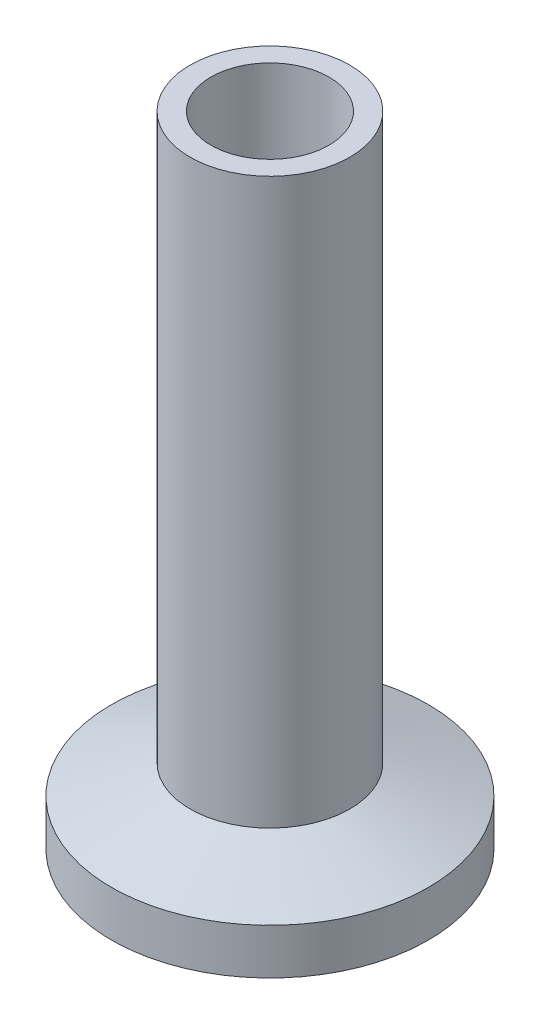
ISO-10303-21;
HEADER;
FILE_DESCRIPTION(('STEP AP214'),'2;1');
FILE_NAME('part.step','',(''),(''),'','','');
FILE_SCHEMA(('AUTOMOTIVE_DESIGN { 1 0 10303 214 1 1 1 1 }'));
ENDSEC;
DATA;
#1=APPLICATION_CONTEXT('core data for automotive mechanical design processes');
#2=APPLICATION_PROTOCOL_DEFINITION('international standard','automotive_design',2000,#1);
#3=PRODUCT_CONTEXT('',#1,'mechanical');
#4=PRODUCT('Part','Part','',(#3));
#5=PRODUCT_RELATED_PRODUCT_CATEGORY('part','',(#4));
#6=PRODUCT_DEFINITION_FORMATION('','',#4);
#7=PRODUCT_DEFINITION_CONTEXT('part definition',#1,'design');
#8=PRODUCT_DEFINITION('design','',#6,#7);
#9=PRODUCT_DEFINITION_SHAPE('','',#8);
#10=(LENGTH_UNIT() NAMED_UNIT(*) SI_UNIT(.MILLI.,.METRE.));
#11=(NAMED_UNIT(*) PLANE_ANGLE_UNIT() SI_UNIT($,.RADIAN.));
#12=(NAMED_UNIT(*) SI_UNIT($,.STERADIAN.) SOLID_ANGLE_UNIT());
#13=UNCERTAINTY_MEASURE_WITH_UNIT(LENGTH_MEASURE(1.E-05),#10,'distance_accuracy_value','');
#14=(GEOMETRIC_REPRESENTATION_CONTEXT(3) GLOBAL_UNCERTAINTY_ASSIGNED_CONTEXT((#13)) GLOBAL_UNIT_ASSIGNED_CONTEXT((#10,
#11,#12)) REPRESENTATION_CONTEXT('',''));
#15=CARTESIAN_POINT('',(0.,0.,0.));
#16=DIRECTION('',(0.,0.,1.));
#17=DIRECTION('',(1.,0.,0.));
#18=AXIS2_PLACEMENT_3D('',#15,#16,#17);
#19=CARTESIAN_POINT('',(0.,0.,0.));
#20=DIRECTION('',(0.,-1.,0.));
#21=DIRECTION('',(0.,0.,-1.00000000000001));
#22=AXIS2_PLACEMENT_3D('',#19,#20,#21);
#23=CYLINDRICAL_SURFACE('',#22,10.922);
#24=CARTESIAN_POINT('',(6.66133814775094E-13,1.32079999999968,1.4432899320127E-12));
#25=DIRECTION('',(0.,-1.,0.));
#26=DIRECTION('',(0.,0.,-1.00000000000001));
#27=AXIS2_PLACEMENT_3D('',#24,#25,#26);
#28=CIRCLE('',#27,10.922);
#29=CARTESIAN_POINT('',(6.65716507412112E-13,1.32079999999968,-10.9219999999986));
#30=VERTEX_POINT('',#29);
#31=EDGE_CURVE('E12',#30,#30,#28,.T.);
#32=ORIENTED_EDGE('',*,*,#31,.F.);
#33=EDGE_LOOP('',(#32));
#34=FACE_BOUND('',#33,.T.);
#35=CARTESIAN_POINT('',(0.,0.,0.));
#36=DIRECTION('',(0.,-1.,0.));
#37=DIRECTION('',(0.,0.,-1.00000000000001));
#38=AXIS2_PLACEMENT_3D('',#35,#36,#37);
#39=CIRCLE('',#38,10.922);
#40=CARTESIAN_POINT('',(0.,0.,-10.9220000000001));
#41=VERTEX_POINT('',#40);
#42=EDGE_CURVE('E72',#41,#41,#39,.T.);
#43=ORIENTED_EDGE('',*,*,#42,.T.);
#44=EDGE_LOOP('',(#43));
#45=FACE_BOUND('',#44,.T.);
#46=ADVANCED_FACE('F38',(#34,#45),#23,.F.);
#47=CARTESIAN_POINT('',(6.66133814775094E-13,1.32079999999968,1.4432899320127E-12));
#48=DIRECTION('',(0.,-1.,0.));
#49=DIRECTION('',(0.,0.,-1.00000000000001));
#50=AXIS2_PLACEMENT_3D('',#47,#48,#49);
#51=TOROIDAL_SURFACE('',#50,10.1473,0.7747);
#52=CARTESIAN_POINT('',(0.,1.85299891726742,1.4432899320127E-12));
#53=DIRECTION('',(0.,-1.,0.));
#54=DIRECTION('',(0.,0.,-1.00000000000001));
#55=AXIS2_PLACEMENT_3D('',#52,#53,#54);
#56=CIRCLE('',#55,9.58433960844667);
#57=CARTESIAN_POINT('',(0.,1.85299891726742,-9.58433960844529));
#58=VERTEX_POINT('',#57);
#59=EDGE_CURVE('E44',#58,#58,#56,.T.);
#60=ORIENTED_EDGE('',*,*,#59,.F.);
#61=EDGE_LOOP('',(#60));
#62=FACE_BOUND('',#61,.T.);
#63=ORIENTED_EDGE('',*,*,#31,.T.);
#64=EDGE_LOOP('',(#63));
#65=FACE_BOUND('',#64,.T.);
#66=ADVANCED_FACE('F121',(#62,#65),#51,.F.);
#67=CARTESIAN_POINT('',(0.,1.85299891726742,1.4432899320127E-12));
#68=DIRECTION('',(0.,1.,0.));
#69=DIRECTION('',(0.,0.,1.00000000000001));
#70=AXIS2_PLACEMENT_3D('',#67,#68,#69);
#71=CONICAL_SURFACE('',#70,9.58433960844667,0.794623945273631);
#72=CARTESIAN_POINT('',(6.66133814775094E-13,0.888999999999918,1.4432899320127E-12));
#73=DIRECTION('',(0.,-1.,0.));
#74=DIRECTION('',(0.,0.,-1.00000000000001));
#75=AXIS2_PLACEMENT_3D('',#72,#73,#74);
#76=CIRCLE('',#75,8.60238725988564);
#77=CARTESIAN_POINT('',(6.6580513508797E-13,0.888999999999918,-8.60238725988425));
#78=VERTEX_POINT('',#77);
#79=EDGE_CURVE('E48',#78,#78,#76,.T.);
#80=ORIENTED_EDGE('',*,*,#79,.F.);
#81=EDGE_LOOP('',(#80));
#82=FACE_BOUND('',#81,.T.);
#83=ORIENTED_EDGE('',*,*,#59,.T.);
#84=EDGE_LOOP('',(#83));
#85=FACE_BOUND('',#84,.T.);
#86=ADVANCED_FACE('F116',(#82,#85),#71,.T.);
#87=CARTESIAN_POINT('',(-8.60238725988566,0.889000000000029,-2.22044604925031E-13));
#88=DIRECTION('',(0.,1.,0.));
#89=DIRECTION('',(0.,0.,1.00000000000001));
#90=AXIS2_PLACEMENT_3D('',#87,#88,#89);
#91=PLANE('',#90);
#92=CARTESIAN_POINT('',(6.66133814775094E-13,0.888999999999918,1.4432899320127E-12));
#93=DIRECTION('',(0.,-1.,0.));
#94=DIRECTION('',(0.,0.,-1.00000000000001));
#95=AXIS2_PLACEMENT_3D('',#92,#93,#94);
#96=CIRCLE('',#95,4.699);
#97=CARTESIAN_POINT('',(6.65954275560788E-13,0.888999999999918,-4.69899999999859));
#98=VERTEX_POINT('',#97);
#99=EDGE_CURVE('E52',#98,#98,#96,.T.);
#100=ORIENTED_EDGE('',*,*,#99,.F.);
#101=EDGE_LOOP('',(#100));
#102=FACE_BOUND('',#101,.T.);
#103=ORIENTED_EDGE('',*,*,#79,.T.);
#104=EDGE_LOOP('',(#103));
#105=FACE_BOUND('',#104,.T.);
#106=ADVANCED_FACE('F110',(#102,#105),#91,.F.);
#107=CARTESIAN_POINT('',(0.,0.,0.));
#108=DIRECTION('',(0.,-1.,0.));
#109=DIRECTION('',(0.,0.,-1.00000000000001));
#110=AXIS2_PLACEMENT_3D('',#107,#108,#109);
#111=CYLINDRICAL_SURFACE('',#110,4.699);
#112=CARTESIAN_POINT('',(6.66133814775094E-13,50.8,1.11022302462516E-13));
#113=DIRECTION('',(0.,-1.,0.));
#114=DIRECTION('',(0.,0.,-1.00000000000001));
#115=AXIS2_PLACEMENT_3D('',#112,#113,#114);
#116=CIRCLE('',#115,4.699);
#117=CARTESIAN_POINT('',(6.65954275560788E-13,50.8,-4.69899999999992));
#118=VERTEX_POINT('',#117);
#119=EDGE_CURVE('E57',#118,#118,#116,.T.);
#120=ORIENTED_EDGE('',*,*,#119,.F.);
#121=EDGE_LOOP('',(#120));
#122=FACE_BOUND('',#121,.T.);
#123=ORIENTED_EDGE('',*,*,#99,.T.);
#124=EDGE_LOOP('',(#123));
#125=FACE_BOUND('',#124,.T.);
#126=ADVANCED_FACE('F104',(#122,#125),#111,.F.);
#127=CARTESIAN_POINT('',(-4.69899999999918,50.7999999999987,1.11022302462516E-12));
#128=DIRECTION('',(0.,-1.,0.));
#129=DIRECTION('',(0.,0.,-1.00000000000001));
#130=AXIS2_PLACEMENT_3D('',#127,#128,#129);
#131=PLANE('',#130);
#132=CARTESIAN_POINT('',(6.66133814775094E-13,50.8,1.11022302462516E-13));
#133=DIRECTION('',(0.,-1.,0.));
#134=DIRECTION('',(0.,0.,-1.00000000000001));
#135=AXIS2_PLACEMENT_3D('',#132,#133,#134);
#136=CIRCLE('',#135,6.35);
#137=CARTESIAN_POINT('',(6.65891194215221E-13,50.8,-6.34999999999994));
#138=VERTEX_POINT('',#137);
#139=EDGE_CURVE('E60',#138,#138,#136,.T.);
#140=ORIENTED_EDGE('',*,*,#139,.F.);
#141=EDGE_LOOP('',(#140));
#142=FACE_BOUND('',#141,.T.);
#143=ORIENTED_EDGE('',*,*,#119,.T.);
#144=EDGE_LOOP('',(#143));
#145=FACE_BOUND('',#144,.T.);
#146=ADVANCED_FACE('F98',(#142,#145),#131,.F.);
#147=CARTESIAN_POINT('',(0.,0.,0.));
#148=DIRECTION('',(0.,-1.,0.));
#149=DIRECTION('',(0.,0.,-1.00000000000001));
#150=AXIS2_PLACEMENT_3D('',#147,#148,#149);
#151=CYLINDRICAL_SURFACE('',#150,6.35);
#152=CARTESIAN_POINT('',(6.66133814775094E-13,5.90643161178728,2.22044604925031E-13));
#153=DIRECTION('',(0.,-1.,0.));
#154=DIRECTION('',(0.,0.,-1.00000000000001));
#155=AXIS2_PLACEMENT_3D('',#152,#153,#154);
#156=CIRCLE('',#155,6.35);
#157=CARTESIAN_POINT('',(6.65891194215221E-13,5.90643161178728,-6.34999999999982));
#158=VERTEX_POINT('',#157);
#159=EDGE_CURVE('E63',#158,#158,#156,.T.);
#160=ORIENTED_EDGE('',*,*,#159,.F.);
#161=EDGE_LOOP('',(#160));
#162=FACE_BOUND('',#161,.T.);
#163=ORIENTED_EDGE('',*,*,#139,.T.);
#164=EDGE_LOOP('',(#163));
#165=FACE_BOUND('',#164,.T.);
#166=ADVANCED_FACE('F92',(#162,#165),#151,.T.);
#167=CARTESIAN_POINT('',(6.66133814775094E-13,5.90643161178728,2.22044604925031E-13));
#168=DIRECTION('',(0.,-1.,0.));
#169=DIRECTION('',(0.,0.,-1.00000000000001));
#170=AXIS2_PLACEMENT_3D('',#167,#168,#169);
#171=CONICAL_SURFACE('',#170,6.35,1.22173047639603);
#172=CARTESIAN_POINT('',(6.66133814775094E-13,3.63219999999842,1.4432899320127E-12));
#173=DIRECTION('',(0.,-1.,0.));
#174=DIRECTION('',(0.,0.,-1.00000000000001));
#175=AXIS2_PLACEMENT_3D('',#172,#173,#174);
#176=CIRCLE('',#175,12.5984);
#177=CARTESIAN_POINT('',(6.65652455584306E-13,3.63219999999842,-12.5983999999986));
#178=VERTEX_POINT('',#177);
#179=EDGE_CURVE('E66',#178,#178,#176,.T.);
#180=ORIENTED_EDGE('',*,*,#179,.F.);
#181=EDGE_LOOP('',(#180));
#182=FACE_BOUND('',#181,.T.);
#183=ORIENTED_EDGE('',*,*,#159,.T.);
#184=EDGE_LOOP('',(#183));
#185=FACE_BOUND('',#184,.T.);
#186=ADVANCED_FACE('F86',(#182,#185),#171,.T.);
#187=CARTESIAN_POINT('',(0.,0.,0.));
#188=DIRECTION('',(0.,-1.,0.));
#189=DIRECTION('',(0.,0.,-1.00000000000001));
#190=AXIS2_PLACEMENT_3D('',#187,#188,#189);
#191=CYLINDRICAL_SURFACE('',#190,12.5984);
#192=CARTESIAN_POINT('',(0.,0.,0.));
#193=DIRECTION('',(0.,-1.,0.));
#194=DIRECTION('',(0.,0.,-1.00000000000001));
#195=AXIS2_PLACEMENT_3D('',#192,#193,#194);
#196=CIRCLE('',#195,12.5984);
#197=CARTESIAN_POINT('',(0.,0.,-12.5984000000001));
#198=VERTEX_POINT('',#197);
#199=EDGE_CURVE('E69',#198,#198,#196,.T.);
#200=ORIENTED_EDGE('',*,*,#199,.F.);
#201=EDGE_LOOP('',(#200));
#202=FACE_BOUND('',#201,.T.);
#203=ORIENTED_EDGE('',*,*,#179,.T.);
#204=EDGE_LOOP('',(#203));
#205=FACE_BOUND('',#204,.T.);
#206=ADVANCED_FACE('F80',(#202,#205),#191,.T.);
#207=CARTESIAN_POINT('',(-12.5984,0.,3.33066907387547E-13));
#208=DIRECTION('',(0.,1.,0.));
#209=DIRECTION('',(0.,0.,1.00000000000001));
#210=AXIS2_PLACEMENT_3D('',#207,#208,#209);
#211=PLANE('',#210);
#212=ORIENTED_EDGE('',*,*,#42,.F.);
#213=EDGE_LOOP('',(#212));
#214=FACE_BOUND('',#213,.T.);
#215=ORIENTED_EDGE('',*,*,#199,.T.);
#216=EDGE_LOOP('',(#215));
#217=FACE_BOUND('',#216,.T.);
#218=ADVANCED_FACE('F77',(#214,#217),#211,.F.);
#219=CLOSED_SHELL('',(#46,#66,#86,#106,#126,#146,#166,#186,#206,#218));
#220=MANIFOLD_SOLID_BREP('B2',#219);
#221=ADVANCED_BREP_SHAPE_REPRESENTATION('',(#18,#220),#14);
#222=SHAPE_DEFINITION_REPRESENTATION(#9,#221);
ENDSEC;
END-ISO-10303-21;
